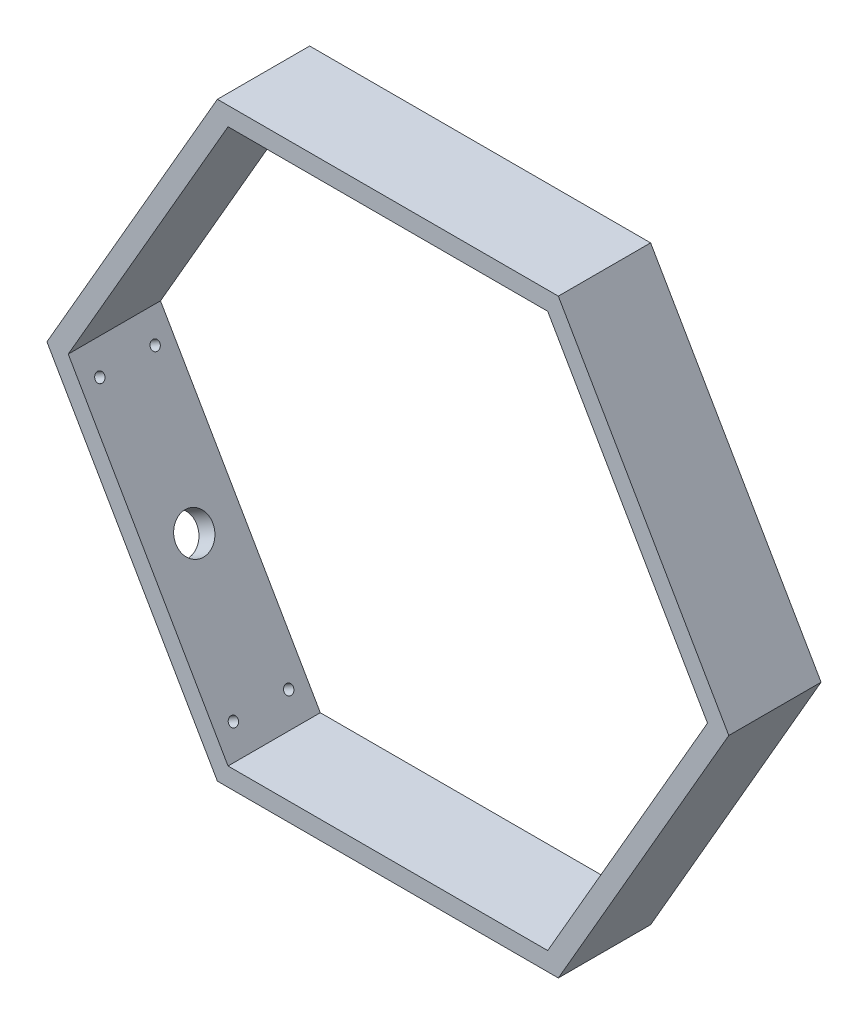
ISO-10303-21;
HEADER;
FILE_DESCRIPTION(('STEP AP214'),'2;1');
FILE_NAME('part.step','',(''),(''),'','','');
FILE_SCHEMA(('AUTOMOTIVE_DESIGN { 1 0 10303 214 1 1 1 1 }'));
ENDSEC;
DATA;
#1=APPLICATION_CONTEXT('core data for automotive mechanical design processes');
#2=APPLICATION_PROTOCOL_DEFINITION('international standard','automotive_design',2000,#1);
#3=PRODUCT_CONTEXT('',#1,'mechanical');
#4=PRODUCT('Part','Part','',(#3));
#5=PRODUCT_RELATED_PRODUCT_CATEGORY('part','',(#4));
#6=PRODUCT_DEFINITION_FORMATION('','',#4);
#7=PRODUCT_DEFINITION_CONTEXT('part definition',#1,'design');
#8=PRODUCT_DEFINITION('design','',#6,#7);
#9=PRODUCT_DEFINITION_SHAPE('','',#8);
#10=(LENGTH_UNIT() NAMED_UNIT(*) SI_UNIT(.MILLI.,.METRE.));
#11=(NAMED_UNIT(*) PLANE_ANGLE_UNIT() SI_UNIT($,.RADIAN.));
#12=(NAMED_UNIT(*) SI_UNIT($,.STERADIAN.) SOLID_ANGLE_UNIT());
#13=UNCERTAINTY_MEASURE_WITH_UNIT(LENGTH_MEASURE(1.E-05),#10,'distance_accuracy_value','');
#14=(GEOMETRIC_REPRESENTATION_CONTEXT(3) GLOBAL_UNCERTAINTY_ASSIGNED_CONTEXT((#13)) GLOBAL_UNIT_ASSIGNED_CONTEXT((#10,
#11,#12)) REPRESENTATION_CONTEXT('',''));
#15=CARTESIAN_POINT('',(0.,0.,0.));
#16=DIRECTION('',(0.,0.,1.));
#17=DIRECTION('',(1.,0.,0.));
#18=AXIS2_PLACEMENT_3D('',#15,#16,#17);
#19=CARTESIAN_POINT('',(0.,0.,31.75));
#20=DIRECTION('',(0.,0.,1.));
#21=DIRECTION('',(1.,0.,0.));
#22=AXIS2_PLACEMENT_3D('',#19,#20,#21);
#23=PLANE('',#22);
#24=DIRECTION('',(0.5,0.866025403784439,0.));
#25=VECTOR('',#24,1.);
#26=CARTESIAN_POINT('',(58.6587873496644,-101.600000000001,31.75));
#27=LINE('',#26,#25);
#28=CARTESIAN_POINT('',(58.6587873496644,-101.600000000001,31.75));
#29=VERTEX_POINT('',#28);
#30=CARTESIAN_POINT('',(117.317574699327,-7.06009094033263E-12,31.75));
#31=VERTEX_POINT('',#30);
#32=EDGE_CURVE('E181',#29,#31,#27,.T.);
#33=ORIENTED_EDGE('',*,*,#32,.T.);
#34=DIRECTION('',(-0.499999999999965,0.866025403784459,0.));
#35=VECTOR('',#34,1.);
#36=CARTESIAN_POINT('',(117.317574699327,-7.06009094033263E-12,31.75));
#37=LINE('',#36,#35);
#38=CARTESIAN_POINT('',(58.658787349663,101.599999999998,31.75));
#39=VERTEX_POINT('',#38);
#40=EDGE_CURVE('E187',#31,#39,#37,.T.);
#41=ORIENTED_EDGE('',*,*,#40,.T.);
#42=DIRECTION('',(-1.,0.,0.));
#43=VECTOR('',#42,1.);
#44=CARTESIAN_POINT('',(58.658787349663,101.599999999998,31.75));
#45=LINE('',#44,#43);
#46=CARTESIAN_POINT('',(-58.6587873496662,101.599999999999,31.75));
#47=VERTEX_POINT('',#46);
#48=EDGE_CURVE('E189',#39,#47,#45,.T.);
#49=ORIENTED_EDGE('',*,*,#48,.T.);
#50=DIRECTION('',(-0.499999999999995,-0.866025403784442,0.));
#51=VECTOR('',#50,1.);
#52=CARTESIAN_POINT('',(-58.6587873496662,101.599999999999,31.75));
#53=LINE('',#52,#51);
#54=CARTESIAN_POINT('',(-117.317574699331,-8.19224245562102E-13,31.75));
#55=VERTEX_POINT('',#54);
#56=EDGE_CURVE('E194',#47,#55,#53,.T.);
#57=ORIENTED_EDGE('',*,*,#56,.T.);
#58=DIRECTION('',(0.500000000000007,-0.866025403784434,0.));
#59=VECTOR('',#58,1.);
#60=CARTESIAN_POINT('',(-117.317574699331,-8.19224245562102E-13,31.75));
#61=LINE('',#60,#59);
#62=CARTESIAN_POINT('',(-58.6587873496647,-101.6,31.75));
#63=VERTEX_POINT('',#62);
#64=EDGE_CURVE('E195',#55,#63,#61,.T.);
#65=ORIENTED_EDGE('',*,*,#64,.T.);
#66=DIRECTION('',(1.,0.,0.));
#67=VECTOR('',#66,1.);
#68=CARTESIAN_POINT('',(-58.6587873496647,-101.6,31.75));
#69=LINE('',#68,#67);
#70=EDGE_CURVE('E192',#63,#29,#69,.T.);
#71=ORIENTED_EDGE('',*,*,#70,.T.);
#72=EDGE_LOOP('',(#33,#41,#49,#57,#65,#71));
#73=FACE_BOUND('',#72,.T.);
#74=DIRECTION('',(-1.,0.,0.));
#75=VECTOR('',#74,1.);
#76=CARTESIAN_POINT('',(54.9926131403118,95.25,31.75));
#77=LINE('',#76,#75);
#78=CARTESIAN_POINT('',(54.9926131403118,95.25,31.75));
#79=VERTEX_POINT('',#78);
#80=CARTESIAN_POINT('',(-54.9926131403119,95.25,31.75));
#81=VERTEX_POINT('',#80);
#82=EDGE_CURVE('E140',#79,#81,#77,.T.);
#83=ORIENTED_EDGE('',*,*,#82,.F.);
#84=DIRECTION('',(-0.5,0.866025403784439,0.));
#85=VECTOR('',#84,1.);
#86=CARTESIAN_POINT('',(109.985226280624,0.,31.75));
#87=LINE('',#86,#85);
#88=CARTESIAN_POINT('',(109.985226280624,0.,31.75));
#89=VERTEX_POINT('',#88);
#90=EDGE_CURVE('E128',#89,#79,#87,.T.);
#91=ORIENTED_EDGE('',*,*,#90,.F.);
#92=DIRECTION('',(0.5,0.866025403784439,0.));
#93=VECTOR('',#92,1.);
#94=CARTESIAN_POINT('',(54.9926131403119,-95.25,31.75));
#95=LINE('',#94,#93);
#96=CARTESIAN_POINT('',(54.9926131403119,-95.25,31.75));
#97=VERTEX_POINT('',#96);
#98=EDGE_CURVE('E159',#97,#89,#95,.T.);
#99=ORIENTED_EDGE('',*,*,#98,.F.);
#100=DIRECTION('',(1.,0.,0.));
#101=VECTOR('',#100,1.);
#102=CARTESIAN_POINT('',(-54.9926131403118,-95.25,31.75));
#103=LINE('',#102,#101);
#104=CARTESIAN_POINT('',(-54.9926131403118,-95.25,31.75));
#105=VERTEX_POINT('',#104);
#106=EDGE_CURVE('E158',#105,#97,#103,.T.);
#107=ORIENTED_EDGE('',*,*,#106,.F.);
#108=DIRECTION('',(0.5,-0.866025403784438,0.));
#109=VECTOR('',#108,1.);
#110=CARTESIAN_POINT('',(-109.985226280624,0.,31.75));
#111=LINE('',#110,#109);
#112=CARTESIAN_POINT('',(-109.985226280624,0.,31.75));
#113=VERTEX_POINT('',#112);
#114=EDGE_CURVE('E153',#113,#105,#111,.T.);
#115=ORIENTED_EDGE('',*,*,#114,.F.);
#116=DIRECTION('',(-0.5,-0.866025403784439,0.));
#117=VECTOR('',#116,1.);
#118=CARTESIAN_POINT('',(-54.9926131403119,95.25,31.75));
#119=LINE('',#118,#117);
#120=EDGE_CURVE('E151',#81,#113,#119,.T.);
#121=ORIENTED_EDGE('',*,*,#120,.F.);
#122=EDGE_LOOP('',(#83,#91,#99,#107,#115,#121));
#123=FACE_BOUND('',#122,.T.);
#124=ADVANCED_FACE('F41',(#73,#123),#23,.T.);
#125=CARTESIAN_POINT('',(0.,0.,0.));
#126=DIRECTION('',(0.,0.,1.));
#127=DIRECTION('',(1.,0.,0.));
#128=AXIS2_PLACEMENT_3D('',#125,#126,#127);
#129=PLANE('',#128);
#130=DIRECTION('',(0.5,0.866025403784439,0.));
#131=VECTOR('',#130,1.);
#132=CARTESIAN_POINT('',(58.6587873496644,-101.600000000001,0.));
#133=LINE('',#132,#131);
#134=CARTESIAN_POINT('',(58.6587873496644,-101.600000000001,0.));
#135=VERTEX_POINT('',#134);
#136=CARTESIAN_POINT('',(117.317574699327,-7.06009094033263E-12,0.));
#137=VERTEX_POINT('',#136);
#138=EDGE_CURVE('E148',#135,#137,#133,.T.);
#139=ORIENTED_EDGE('',*,*,#138,.F.);
#140=DIRECTION('',(1.,0.,0.));
#141=VECTOR('',#140,1.);
#142=CARTESIAN_POINT('',(-58.6587873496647,-101.6,0.));
#143=LINE('',#142,#141);
#144=CARTESIAN_POINT('',(-58.6587873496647,-101.6,0.));
#145=VERTEX_POINT('',#144);
#146=EDGE_CURVE('E190',#145,#135,#143,.T.);
#147=ORIENTED_EDGE('',*,*,#146,.F.);
#148=DIRECTION('',(0.500000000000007,-0.866025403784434,0.));
#149=VECTOR('',#148,1.);
#150=CARTESIAN_POINT('',(-117.317574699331,-8.19224245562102E-13,0.));
#151=LINE('',#150,#149);
#152=CARTESIAN_POINT('',(-117.317574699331,-8.19224245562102E-13,0.));
#153=VERTEX_POINT('',#152);
#154=EDGE_CURVE('E206',#153,#145,#151,.T.);
#155=ORIENTED_EDGE('',*,*,#154,.F.);
#156=DIRECTION('',(-0.499999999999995,-0.866025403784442,0.));
#157=VECTOR('',#156,1.);
#158=CARTESIAN_POINT('',(-58.6587873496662,101.599999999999,0.));
#159=LINE('',#158,#157);
#160=CARTESIAN_POINT('',(-58.6587873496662,101.599999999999,0.));
#161=VERTEX_POINT('',#160);
#162=EDGE_CURVE('E204',#161,#153,#159,.T.);
#163=ORIENTED_EDGE('',*,*,#162,.F.);
#164=DIRECTION('',(-1.,0.,0.));
#165=VECTOR('',#164,1.);
#166=CARTESIAN_POINT('',(58.658787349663,101.599999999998,0.));
#167=LINE('',#166,#165);
#168=CARTESIAN_POINT('',(58.658787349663,101.599999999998,0.));
#169=VERTEX_POINT('',#168);
#170=EDGE_CURVE('E205',#169,#161,#167,.T.);
#171=ORIENTED_EDGE('',*,*,#170,.F.);
#172=DIRECTION('',(-0.499999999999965,0.866025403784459,0.));
#173=VECTOR('',#172,1.);
#174=CARTESIAN_POINT('',(117.317574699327,-7.06009094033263E-12,0.));
#175=LINE('',#174,#173);
#176=EDGE_CURVE('E199',#137,#169,#175,.T.);
#177=ORIENTED_EDGE('',*,*,#176,.F.);
#178=EDGE_LOOP('',(#139,#147,#155,#163,#171,#177));
#179=FACE_BOUND('',#178,.T.);
#180=DIRECTION('',(-0.5,0.866025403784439,0.));
#181=VECTOR('',#180,1.);
#182=CARTESIAN_POINT('',(109.985226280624,0.,0.));
#183=LINE('',#182,#181);
#184=CARTESIAN_POINT('',(109.985226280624,0.,0.));
#185=VERTEX_POINT('',#184);
#186=CARTESIAN_POINT('',(54.9926131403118,95.25,0.));
#187=VERTEX_POINT('',#186);
#188=EDGE_CURVE('E64',#185,#187,#183,.T.);
#189=ORIENTED_EDGE('',*,*,#188,.T.);
#190=DIRECTION('',(-1.,0.,0.));
#191=VECTOR('',#190,1.);
#192=CARTESIAN_POINT('',(54.9926131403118,95.25,0.));
#193=LINE('',#192,#191);
#194=CARTESIAN_POINT('',(-54.9926131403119,95.25,0.));
#195=VERTEX_POINT('',#194);
#196=EDGE_CURVE('E144',#187,#195,#193,.T.);
#197=ORIENTED_EDGE('',*,*,#196,.T.);
#198=DIRECTION('',(-0.5,-0.866025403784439,0.));
#199=VECTOR('',#198,1.);
#200=CARTESIAN_POINT('',(-54.9926131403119,95.25,0.));
#201=LINE('',#200,#199);
#202=CARTESIAN_POINT('',(-109.985226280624,0.,0.));
#203=VERTEX_POINT('',#202);
#204=EDGE_CURVE('E164',#195,#203,#201,.T.);
#205=ORIENTED_EDGE('',*,*,#204,.T.);
#206=DIRECTION('',(0.5,-0.866025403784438,0.));
#207=VECTOR('',#206,1.);
#208=CARTESIAN_POINT('',(-109.985226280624,0.,0.));
#209=LINE('',#208,#207);
#210=CARTESIAN_POINT('',(-54.9926131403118,-95.25,0.));
#211=VERTEX_POINT('',#210);
#212=EDGE_CURVE('E169',#203,#211,#209,.T.);
#213=ORIENTED_EDGE('',*,*,#212,.T.);
#214=DIRECTION('',(1.,0.,0.));
#215=VECTOR('',#214,1.);
#216=CARTESIAN_POINT('',(-54.9926131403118,-95.25,0.));
#217=LINE('',#216,#215);
#218=CARTESIAN_POINT('',(54.9926131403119,-95.25,0.));
#219=VERTEX_POINT('',#218);
#220=EDGE_CURVE('E172',#211,#219,#217,.T.);
#221=ORIENTED_EDGE('',*,*,#220,.T.);
#222=DIRECTION('',(0.5,0.866025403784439,0.));
#223=VECTOR('',#222,1.);
#224=CARTESIAN_POINT('',(54.9926131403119,-95.25,0.));
#225=LINE('',#224,#223);
#226=EDGE_CURVE('E138',#219,#185,#225,.T.);
#227=ORIENTED_EDGE('',*,*,#226,.T.);
#228=EDGE_LOOP('',(#189,#197,#205,#213,#221,#227));
#229=FACE_BOUND('',#228,.T.);
#230=ADVANCED_FACE('F226',(#179,#229),#129,.F.);
#231=CARTESIAN_POINT('',(58.6587873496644,-101.600000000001,31.75));
#232=DIRECTION('',(-0.866025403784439,0.5,0.));
#233=DIRECTION('',(-0.5,-0.866025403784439,0.));
#234=AXIS2_PLACEMENT_3D('',#231,#232,#233);
#235=PLANE('',#234);
#236=ORIENTED_EDGE('',*,*,#138,.T.);
#237=DIRECTION('',(0.,0.,-1.));
#238=VECTOR('',#237,1.);
#239=CARTESIAN_POINT('',(117.317574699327,-7.06009094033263E-12,31.75));
#240=LINE('',#239,#238);
#241=EDGE_CURVE('E11',#31,#137,#240,.T.);
#242=ORIENTED_EDGE('',*,*,#241,.F.);
#243=ORIENTED_EDGE('',*,*,#32,.F.);
#244=DIRECTION('',(0.,0.,-1.));
#245=VECTOR('',#244,1.);
#246=CARTESIAN_POINT('',(58.6587873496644,-101.600000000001,31.75));
#247=LINE('',#246,#245);
#248=EDGE_CURVE('E197',#29,#135,#247,.T.);
#249=ORIENTED_EDGE('',*,*,#248,.T.);
#250=EDGE_LOOP('',(#236,#242,#243,#249));
#251=FACE_BOUND('',#250,.T.);
#252=ADVANCED_FACE('F43',(#251),#235,.F.);
#253=CARTESIAN_POINT('',(117.317574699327,-7.06009094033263E-12,31.75));
#254=DIRECTION('',(-0.866025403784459,-0.499999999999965,0.));
#255=DIRECTION('',(0.499999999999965,-0.866025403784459,0.));
#256=AXIS2_PLACEMENT_3D('',#253,#254,#255);
#257=PLANE('',#256);
#258=ORIENTED_EDGE('',*,*,#176,.T.);
#259=DIRECTION('',(0.,0.,-1.));
#260=VECTOR('',#259,1.);
#261=CARTESIAN_POINT('',(58.658787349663,101.599999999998,31.75));
#262=LINE('',#261,#260);
#263=EDGE_CURVE('E47',#39,#169,#262,.T.);
#264=ORIENTED_EDGE('',*,*,#263,.F.);
#265=ORIENTED_EDGE('',*,*,#40,.F.);
#266=ORIENTED_EDGE('',*,*,#241,.T.);
#267=EDGE_LOOP('',(#258,#264,#265,#266));
#268=FACE_BOUND('',#267,.T.);
#269=ADVANCED_FACE('F246',(#268),#257,.F.);
#270=CARTESIAN_POINT('',(58.658787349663,101.599999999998,31.75));
#271=DIRECTION('',(0.,-1.,0.));
#272=DIRECTION('',(1.,0.,0.));
#273=AXIS2_PLACEMENT_3D('',#270,#271,#272);
#274=PLANE('',#273);
#275=ORIENTED_EDGE('',*,*,#170,.T.);
#276=DIRECTION('',(0.,0.,-1.));
#277=VECTOR('',#276,1.);
#278=CARTESIAN_POINT('',(-58.6587873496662,101.599999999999,31.75));
#279=LINE('',#278,#277);
#280=EDGE_CURVE('E220',#47,#161,#279,.T.);
#281=ORIENTED_EDGE('',*,*,#280,.F.);
#282=ORIENTED_EDGE('',*,*,#48,.F.);
#283=ORIENTED_EDGE('',*,*,#263,.T.);
#284=EDGE_LOOP('',(#275,#281,#282,#283));
#285=FACE_BOUND('',#284,.T.);
#286=ADVANCED_FACE('F221',(#285),#274,.F.);
#287=CARTESIAN_POINT('',(-58.6587873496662,101.599999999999,31.75));
#288=DIRECTION('',(0.866025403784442,-0.499999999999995,0.));
#289=DIRECTION('',(0.499999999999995,0.866025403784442,0.));
#290=AXIS2_PLACEMENT_3D('',#287,#288,#289);
#291=PLANE('',#290);
#292=ORIENTED_EDGE('',*,*,#162,.T.);
#293=DIRECTION('',(0.,0.,-1.));
#294=VECTOR('',#293,1.);
#295=CARTESIAN_POINT('',(-117.317574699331,-8.19224245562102E-13,31.75));
#296=LINE('',#295,#294);
#297=EDGE_CURVE('E212',#55,#153,#296,.T.);
#298=ORIENTED_EDGE('',*,*,#297,.F.);
#299=ORIENTED_EDGE('',*,*,#56,.F.);
#300=ORIENTED_EDGE('',*,*,#280,.T.);
#301=EDGE_LOOP('',(#292,#298,#299,#300));
#302=FACE_BOUND('',#301,.T.);
#303=ADVANCED_FACE('F237',(#302),#291,.F.);
#304=CARTESIAN_POINT('',(-117.317574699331,-8.19224245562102E-13,31.75));
#305=DIRECTION('',(0.866025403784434,0.500000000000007,0.));
#306=DIRECTION('',(-0.500000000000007,0.866025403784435,0.));
#307=AXIS2_PLACEMENT_3D('',#304,#305,#306);
#308=PLANE('',#307);
#309=CARTESIAN_POINT('',(-110.967574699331,-10.9985226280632,25.4));
#310=DIRECTION('',(-0.866025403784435,-0.500000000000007,0.));
#311=DIRECTION('',(0.500000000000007,-0.866025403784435,0.));
#312=AXIS2_PLACEMENT_3D('',#309,#310,#311);
#313=CIRCLE('',#312,1.5875);
#314=CARTESIAN_POINT('',(-110.173824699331,-12.3733379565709,25.4));
#315=VERTEX_POINT('',#314);
#316=EDGE_CURVE('E327',#315,#315,#313,.T.);
#317=ORIENTED_EDGE('',*,*,#316,.F.);
#318=EDGE_LOOP('',(#317));
#319=FACE_BOUND('',#318,.T.);
#320=CARTESIAN_POINT('',(-65.0087873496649,-90.6014773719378,6.35));
#321=DIRECTION('',(-0.866025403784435,-0.500000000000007,0.));
#322=DIRECTION('',(0.500000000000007,-0.866025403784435,0.));
#323=AXIS2_PLACEMENT_3D('',#320,#321,#322);
#324=CIRCLE('',#323,1.5875);
#325=CARTESIAN_POINT('',(-64.2150373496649,-91.9762927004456,6.35));
#326=VERTEX_POINT('',#325);
#327=EDGE_CURVE('E316',#326,#326,#324,.T.);
#328=ORIENTED_EDGE('',*,*,#327,.F.);
#329=EDGE_LOOP('',(#328));
#330=FACE_BOUND('',#329,.T.);
#331=CARTESIAN_POINT('',(-65.0087873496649,-90.6014773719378,25.4));
#332=DIRECTION('',(-0.866025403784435,-0.500000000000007,0.));
#333=DIRECTION('',(0.500000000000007,-0.866025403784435,0.));
#334=AXIS2_PLACEMENT_3D('',#331,#332,#333);
#335=CIRCLE('',#334,1.5875);
#336=CARTESIAN_POINT('',(-64.2150373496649,-91.9762927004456,25.4));
#337=VERTEX_POINT('',#336);
#338=EDGE_CURVE('E315',#337,#337,#335,.T.);
#339=ORIENTED_EDGE('',*,*,#338,.F.);
#340=EDGE_LOOP('',(#339));
#341=FACE_BOUND('',#340,.T.);
#342=CARTESIAN_POINT('',(-87.9881810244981,-50.8000000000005,15.875));
#343=DIRECTION('',(-0.866025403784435,-0.500000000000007,0.));
#344=DIRECTION('',(0.500000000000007,-0.866025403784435,0.));
#345=AXIS2_PLACEMENT_3D('',#342,#343,#344);
#346=CIRCLE('',#345,6.35);
#347=CARTESIAN_POINT('',(-84.8131810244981,-56.2992613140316,15.875));
#348=VERTEX_POINT('',#347);
#349=EDGE_CURVE('E317',#348,#348,#346,.T.);
#350=ORIENTED_EDGE('',*,*,#349,.F.);
#351=EDGE_LOOP('',(#350));
#352=FACE_BOUND('',#351,.T.);
#353=CARTESIAN_POINT('',(-110.967574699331,-10.9985226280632,6.35));
#354=DIRECTION('',(-0.866025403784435,-0.500000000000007,0.));
#355=DIRECTION('',(0.500000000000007,-0.866025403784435,0.));
#356=AXIS2_PLACEMENT_3D('',#353,#354,#355);
#357=CIRCLE('',#356,1.5875);
#358=CARTESIAN_POINT('',(-110.173824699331,-12.3733379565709,6.35));
#359=VERTEX_POINT('',#358);
#360=EDGE_CURVE('E162',#359,#359,#357,.T.);
#361=ORIENTED_EDGE('',*,*,#360,.F.);
#362=EDGE_LOOP('',(#361));
#363=FACE_BOUND('',#362,.T.);
#364=ORIENTED_EDGE('',*,*,#154,.T.);
#365=DIRECTION('',(0.,0.,-1.));
#366=VECTOR('',#365,1.);
#367=CARTESIAN_POINT('',(-58.6587873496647,-101.6,31.75));
#368=LINE('',#367,#366);
#369=EDGE_CURVE('E211',#63,#145,#368,.T.);
#370=ORIENTED_EDGE('',*,*,#369,.F.);
#371=ORIENTED_EDGE('',*,*,#64,.F.);
#372=ORIENTED_EDGE('',*,*,#297,.T.);
#373=EDGE_LOOP('',(#364,#370,#371,#372));
#374=FACE_BOUND('',#373,.T.);
#375=ADVANCED_FACE('F238',(#319,#330,#341,#352,#363,#374),#308,.F.);
#376=CARTESIAN_POINT('',(-58.6587873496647,-101.6,31.75));
#377=DIRECTION('',(0.,1.,0.));
#378=DIRECTION('',(-1.,0.,0.));
#379=AXIS2_PLACEMENT_3D('',#376,#377,#378);
#380=PLANE('',#379);
#381=ORIENTED_EDGE('',*,*,#146,.T.);
#382=ORIENTED_EDGE('',*,*,#248,.F.);
#383=ORIENTED_EDGE('',*,*,#70,.F.);
#384=ORIENTED_EDGE('',*,*,#369,.T.);
#385=EDGE_LOOP('',(#381,#382,#383,#384));
#386=FACE_BOUND('',#385,.T.);
#387=ADVANCED_FACE('F247',(#386),#380,.F.);
#388=CARTESIAN_POINT('',(109.985226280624,0.,31.75));
#389=DIRECTION('',(-0.866025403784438,-0.5,0.));
#390=DIRECTION('',(0.5,-0.866025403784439,0.));
#391=AXIS2_PLACEMENT_3D('',#388,#389,#390);
#392=PLANE('',#391);
#393=ORIENTED_EDGE('',*,*,#188,.F.);
#394=DIRECTION('',(0.,0.,-1.));
#395=VECTOR('',#394,1.);
#396=CARTESIAN_POINT('',(109.985226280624,0.,31.75));
#397=LINE('',#396,#395);
#398=EDGE_CURVE('E134',#89,#185,#397,.T.);
#399=ORIENTED_EDGE('',*,*,#398,.F.);
#400=ORIENTED_EDGE('',*,*,#90,.T.);
#401=DIRECTION('',(0.,0.,-1.));
#402=VECTOR('',#401,1.);
#403=CARTESIAN_POINT('',(54.9926131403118,95.25,31.75));
#404=LINE('',#403,#402);
#405=EDGE_CURVE('E133',#79,#187,#404,.T.);
#406=ORIENTED_EDGE('',*,*,#405,.T.);
#407=EDGE_LOOP('',(#393,#399,#400,#406));
#408=FACE_BOUND('',#407,.T.);
#409=ADVANCED_FACE('F135',(#408),#392,.T.);
#410=CARTESIAN_POINT('',(54.9926131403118,95.25,31.75));
#411=DIRECTION('',(0.,-1.,0.));
#412=DIRECTION('',(0.,0.,-1.));
#413=AXIS2_PLACEMENT_3D('',#410,#411,#412);
#414=PLANE('',#413);
#415=ORIENTED_EDGE('',*,*,#196,.F.);
#416=ORIENTED_EDGE('',*,*,#405,.F.);
#417=ORIENTED_EDGE('',*,*,#82,.T.);
#418=DIRECTION('',(0.,0.,-1.));
#419=VECTOR('',#418,1.);
#420=CARTESIAN_POINT('',(-54.9926131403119,95.25,31.75));
#421=LINE('',#420,#419);
#422=EDGE_CURVE('E150',#81,#195,#421,.T.);
#423=ORIENTED_EDGE('',*,*,#422,.T.);
#424=EDGE_LOOP('',(#415,#416,#417,#423));
#425=FACE_BOUND('',#424,.T.);
#426=ADVANCED_FACE('F142',(#425),#414,.T.);
#427=CARTESIAN_POINT('',(-54.9926131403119,95.25,31.75));
#428=DIRECTION('',(0.866025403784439,-0.5,0.));
#429=DIRECTION('',(0.5,0.866025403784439,0.));
#430=AXIS2_PLACEMENT_3D('',#427,#428,#429);
#431=PLANE('',#430);
#432=ORIENTED_EDGE('',*,*,#204,.F.);
#433=ORIENTED_EDGE('',*,*,#422,.F.);
#434=ORIENTED_EDGE('',*,*,#120,.T.);
#435=DIRECTION('',(0.,0.,-1.));
#436=VECTOR('',#435,1.);
#437=CARTESIAN_POINT('',(-109.985226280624,0.,31.75));
#438=LINE('',#437,#436);
#439=EDGE_CURVE('E177',#113,#203,#438,.T.);
#440=ORIENTED_EDGE('',*,*,#439,.T.);
#441=EDGE_LOOP('',(#432,#433,#434,#440));
#442=FACE_BOUND('',#441,.T.);
#443=ADVANCED_FACE('F269',(#442),#431,.T.);
#444=CARTESIAN_POINT('',(-109.985226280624,0.,31.75));
#445=DIRECTION('',(0.866025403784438,0.5,0.));
#446=DIRECTION('',(-0.5,0.866025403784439,0.));
#447=AXIS2_PLACEMENT_3D('',#444,#445,#446);
#448=PLANE('',#447);
#449=CARTESIAN_POINT('',(-105.4683133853,-7.8235226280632,25.4));
#450=DIRECTION('',(0.866025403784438,0.5,0.));
#451=DIRECTION('',(-0.5,0.866025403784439,0.));
#452=AXIS2_PLACEMENT_3D('',#449,#450,#451);
#453=CIRCLE('',#452,1.5875);
#454=CARTESIAN_POINT('',(-106.2620633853,-6.4487072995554,25.4));
#455=VERTEX_POINT('',#454);
#456=EDGE_CURVE('E322',#455,#455,#453,.F.);
#457=ORIENTED_EDGE('',*,*,#456,.T.);
#458=EDGE_LOOP('',(#457));
#459=FACE_BOUND('',#458,.T.);
#460=CARTESIAN_POINT('',(-59.5095260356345,-87.4264773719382,6.35));
#461=DIRECTION('',(0.866025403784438,0.5,0.));
#462=DIRECTION('',(-0.5,0.866025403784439,0.));
#463=AXIS2_PLACEMENT_3D('',#460,#461,#462);
#464=CIRCLE('',#463,1.5875);
#465=CARTESIAN_POINT('',(-60.3032760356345,-86.0516620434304,6.35));
#466=VERTEX_POINT('',#465);
#467=EDGE_CURVE('E332',#466,#466,#464,.F.);
#468=ORIENTED_EDGE('',*,*,#467,.T.);
#469=EDGE_LOOP('',(#468));
#470=FACE_BOUND('',#469,.T.);
#471=CARTESIAN_POINT('',(-59.5095260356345,-87.4264773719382,25.4));
#472=DIRECTION('',(0.866025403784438,0.5,0.));
#473=DIRECTION('',(-0.5,0.866025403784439,0.));
#474=AXIS2_PLACEMENT_3D('',#471,#472,#473);
#475=CIRCLE('',#474,1.5875);
#476=CARTESIAN_POINT('',(-60.3032760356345,-86.0516620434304,25.4));
#477=VERTEX_POINT('',#476);
#478=EDGE_CURVE('E310',#477,#477,#475,.F.);
#479=ORIENTED_EDGE('',*,*,#478,.T.);
#480=EDGE_LOOP('',(#479));
#481=FACE_BOUND('',#480,.T.);
#482=CARTESIAN_POINT('',(-82.4889197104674,-47.6250000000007,15.875));
#483=DIRECTION('',(0.866025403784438,0.5,0.));
#484=DIRECTION('',(-0.5,0.866025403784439,0.));
#485=AXIS2_PLACEMENT_3D('',#482,#483,#484);
#486=CIRCLE('',#485,6.35);
#487=CARTESIAN_POINT('',(-85.6639197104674,-42.1257386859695,15.875));
#488=VERTEX_POINT('',#487);
#489=EDGE_CURVE('E314',#488,#488,#486,.F.);
#490=ORIENTED_EDGE('',*,*,#489,.T.);
#491=EDGE_LOOP('',(#490));
#492=FACE_BOUND('',#491,.T.);
#493=CARTESIAN_POINT('',(-105.4683133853,-7.8235226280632,6.35));
#494=DIRECTION('',(0.866025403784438,0.5,0.));
#495=DIRECTION('',(-0.5,0.866025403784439,0.));
#496=AXIS2_PLACEMENT_3D('',#493,#494,#495);
#497=CIRCLE('',#496,1.5875);
#498=CARTESIAN_POINT('',(-106.2620633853,-6.4487072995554,6.35));
#499=VERTEX_POINT('',#498);
#500=EDGE_CURVE('E330',#499,#499,#497,.F.);
#501=ORIENTED_EDGE('',*,*,#500,.T.);
#502=EDGE_LOOP('',(#501));
#503=FACE_BOUND('',#502,.T.);
#504=ORIENTED_EDGE('',*,*,#212,.F.);
#505=ORIENTED_EDGE('',*,*,#439,.F.);
#506=ORIENTED_EDGE('',*,*,#114,.T.);
#507=DIRECTION('',(0.,0.,-1.));
#508=VECTOR('',#507,1.);
#509=CARTESIAN_POINT('',(-54.9926131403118,-95.25,31.75));
#510=LINE('',#509,#508);
#511=EDGE_CURVE('E180',#105,#211,#510,.T.);
#512=ORIENTED_EDGE('',*,*,#511,.T.);
#513=EDGE_LOOP('',(#504,#505,#506,#512));
#514=FACE_BOUND('',#513,.T.);
#515=ADVANCED_FACE('F272',(#459,#470,#481,#492,#503,#514),#448,.T.);
#516=CARTESIAN_POINT('',(-54.9926131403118,-95.25,31.75));
#517=DIRECTION('',(0.,1.,0.));
#518=DIRECTION('',(-1.,0.,0.));
#519=AXIS2_PLACEMENT_3D('',#516,#517,#518);
#520=PLANE('',#519);
#521=ORIENTED_EDGE('',*,*,#220,.F.);
#522=ORIENTED_EDGE('',*,*,#511,.F.);
#523=ORIENTED_EDGE('',*,*,#106,.T.);
#524=DIRECTION('',(0.,0.,-1.));
#525=VECTOR('',#524,1.);
#526=CARTESIAN_POINT('',(54.9926131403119,-95.25,31.75));
#527=LINE('',#526,#525);
#528=EDGE_CURVE('E57',#97,#219,#527,.T.);
#529=ORIENTED_EDGE('',*,*,#528,.T.);
#530=EDGE_LOOP('',(#521,#522,#523,#529));
#531=FACE_BOUND('',#530,.T.);
#532=ADVANCED_FACE('F280',(#531),#520,.T.);
#533=CARTESIAN_POINT('',(54.9926131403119,-95.25,31.75));
#534=DIRECTION('',(-0.866025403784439,0.5,0.));
#535=DIRECTION('',(-0.5,-0.866025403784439,0.));
#536=AXIS2_PLACEMENT_3D('',#533,#534,#535);
#537=PLANE('',#536);
#538=ORIENTED_EDGE('',*,*,#226,.F.);
#539=ORIENTED_EDGE('',*,*,#528,.F.);
#540=ORIENTED_EDGE('',*,*,#98,.T.);
#541=ORIENTED_EDGE('',*,*,#398,.T.);
#542=EDGE_LOOP('',(#538,#539,#540,#541));
#543=FACE_BOUND('',#542,.T.);
#544=ADVANCED_FACE('F282',(#543),#537,.T.);
#545=CARTESIAN_POINT('',(109.004060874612,116.002160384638,6.35));
#546=DIRECTION('',(-0.866025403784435,-0.500000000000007,0.));
#547=DIRECTION('',(0.500000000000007,-0.866025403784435,0.));
#548=AXIS2_PLACEMENT_3D('',#545,#546,#547);
#549=CYLINDRICAL_SURFACE('',#548,1.5875);
#550=ORIENTED_EDGE('',*,*,#500,.F.);
#551=EDGE_LOOP('',(#550));
#552=FACE_BOUND('',#551,.T.);
#553=ORIENTED_EDGE('',*,*,#360,.T.);
#554=EDGE_LOOP('',(#553));
#555=FACE_BOUND('',#554,.T.);
#556=ADVANCED_FACE('F281',(#552,#555),#549,.F.);
#557=CARTESIAN_POINT('',(131.983454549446,76.2006830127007,15.875));
#558=DIRECTION('',(-0.866025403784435,-0.500000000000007,0.));
#559=DIRECTION('',(0.500000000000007,-0.866025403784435,0.));
#560=AXIS2_PLACEMENT_3D('',#557,#558,#559);
#561=CYLINDRICAL_SURFACE('',#560,6.35);
#562=ORIENTED_EDGE('',*,*,#489,.F.);
#563=EDGE_LOOP('',(#562));
#564=FACE_BOUND('',#563,.T.);
#565=ORIENTED_EDGE('',*,*,#349,.T.);
#566=EDGE_LOOP('',(#565));
#567=FACE_BOUND('',#566,.T.);
#568=ADVANCED_FACE('F290',(#564,#567),#561,.F.);
#569=CARTESIAN_POINT('',(154.962848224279,36.3992056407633,25.4));
#570=DIRECTION('',(-0.866025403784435,-0.500000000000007,0.));
#571=DIRECTION('',(0.500000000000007,-0.866025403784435,0.));
#572=AXIS2_PLACEMENT_3D('',#569,#570,#571);
#573=CYLINDRICAL_SURFACE('',#572,1.5875);
#574=ORIENTED_EDGE('',*,*,#478,.F.);
#575=EDGE_LOOP('',(#574));
#576=FACE_BOUND('',#575,.T.);
#577=ORIENTED_EDGE('',*,*,#338,.T.);
#578=EDGE_LOOP('',(#577));
#579=FACE_BOUND('',#578,.T.);
#580=ADVANCED_FACE('F294',(#576,#579),#573,.F.);
#581=CARTESIAN_POINT('',(154.962848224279,36.3992056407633,6.35));
#582=DIRECTION('',(-0.866025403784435,-0.500000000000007,0.));
#583=DIRECTION('',(0.500000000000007,-0.866025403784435,0.));
#584=AXIS2_PLACEMENT_3D('',#581,#582,#583);
#585=CYLINDRICAL_SURFACE('',#584,1.5875);
#586=ORIENTED_EDGE('',*,*,#467,.F.);
#587=EDGE_LOOP('',(#586));
#588=FACE_BOUND('',#587,.T.);
#589=ORIENTED_EDGE('',*,*,#327,.T.);
#590=EDGE_LOOP('',(#589));
#591=FACE_BOUND('',#590,.T.);
#592=ADVANCED_FACE('F287',(#588,#591),#585,.F.);
#593=CARTESIAN_POINT('',(109.004060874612,116.002160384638,25.4));
#594=DIRECTION('',(-0.866025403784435,-0.500000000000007,0.));
#595=DIRECTION('',(0.500000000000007,-0.866025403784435,0.));
#596=AXIS2_PLACEMENT_3D('',#593,#594,#595);
#597=CYLINDRICAL_SURFACE('',#596,1.5875);
#598=ORIENTED_EDGE('',*,*,#456,.F.);
#599=EDGE_LOOP('',(#598));
#600=FACE_BOUND('',#599,.T.);
#601=ORIENTED_EDGE('',*,*,#316,.T.);
#602=EDGE_LOOP('',(#601));
#603=FACE_BOUND('',#602,.T.);
#604=ADVANCED_FACE('F291',(#600,#603),#597,.F.);
#605=CLOSED_SHELL('',(#124,#230,#252,#269,#286,#303,#375,#387,#409,#426,#443,#515,#532,#544,
#556,#568,#580,#592,#604));
#606=MANIFOLD_SOLID_BREP('B2',#605);
#607=ADVANCED_BREP_SHAPE_REPRESENTATION('',(#18,#606),#14);
#608=SHAPE_DEFINITION_REPRESENTATION(#9,#607);
ENDSEC;
END-ISO-10303-21;
